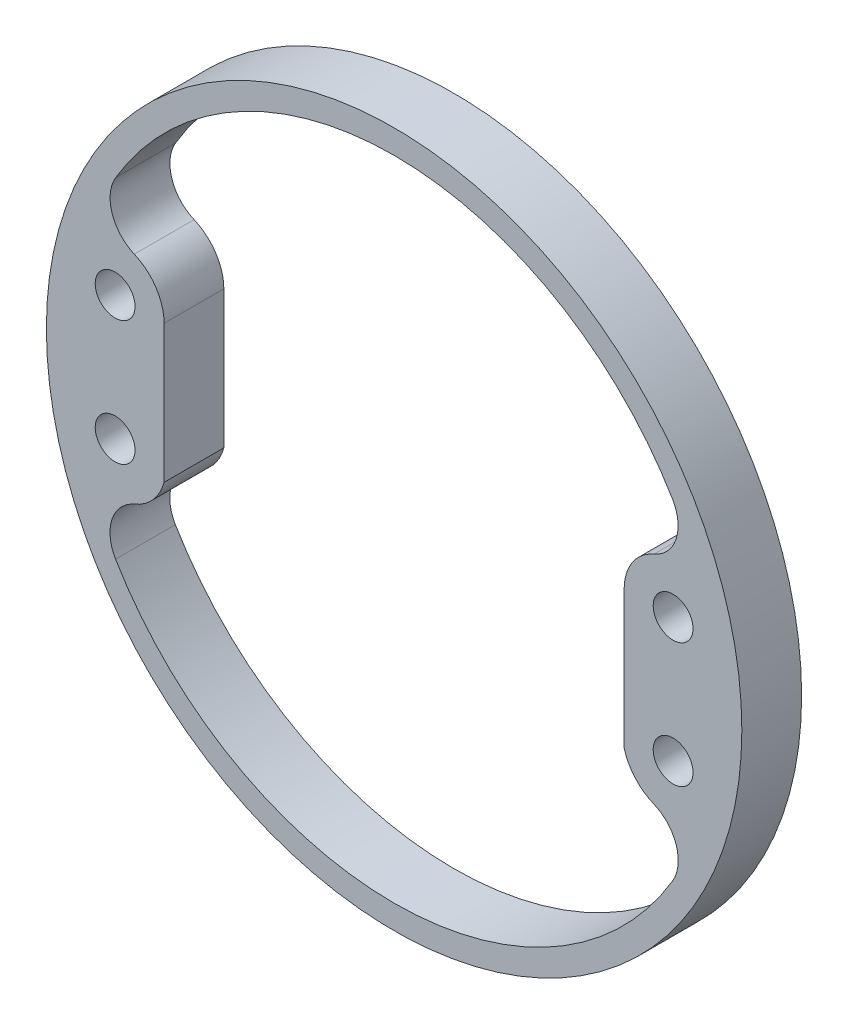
from build123d import *

# Parameters (mm, degrees)
SKETCH1_R      = 22.1615
SKETCH1_R_2    = 1.27
EXTRUDE2_DEPTH = 3.81
FILLET2_R      = 2.54


with BuildPart() as part:
    # Sketch1 → Extrude2 (new body)
    with BuildSketch(Plane.XY):
        with Locations(Location((0, 0, 0), (0, 0, 180))):
            Circle(SKETCH1_R)
        with Locations(Location((-17.78, -3.901479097, 0), (0, 0, 180))):
            Circle(SKETCH1_R_2, mode=Mode.SUBTRACT)
        with Locations(Location((17.78, -3.901479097, 0), (0, 0, 180))):
            Circle(SKETCH1_R_2, mode=Mode.SUBTRACT)
        with Locations(Location((-17.78, 4.036020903, 0), (0, 0, 180))):
            Circle(SKETCH1_R_2, mode=Mode.SUBTRACT)
        with BuildLine():
            Line((-14.660582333, -0.79375), (-14.660582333, 4.036020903))
            ThreePointArc((-14.660582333, 4.036020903), (-16.330721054, 6.798331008), (-19.552749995, 6.602755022))
            ThreePointArc((-19.552749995, 6.602755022), (0, 20.6375), (19.552749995, 6.602755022))
            ThreePointArc((19.552749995, 6.602755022), (16.330721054, 6.798331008), (14.660582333, 4.036020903))
            Line((14.660582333, 4.036020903), (14.660582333, -0.79375))
            Line((14.660582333, -0.79375), (14.660582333, -2.36859262))
            Line((14.660582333, -2.36859262), (14.660582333, -4.743362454))
            ThreePointArc((14.660582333, -4.743362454), (16.632082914, -6.921714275), (19.552749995, -6.602755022))
            ThreePointArc((19.552749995, -6.602755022), (0, -20.6375), (-19.552749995, -6.602755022))
            ThreePointArc((-19.552749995, -6.602755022), (-16.632082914, -6.921714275), (-14.660582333, -4.743362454))
            Line((-14.660582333, -4.743362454), (-14.660582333, -0.79375))
        make_face(mode=Mode.SUBTRACT)
        with Locations(Location((17.78, 4.036020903, 0), (0, 0, 180))):
            Circle(SKETCH1_R_2, mode=Mode.SUBTRACT)
    extrude(amount=EXTRUDE2_DEPTH)

    # Fillet2
    fillet2_edges = [part.edges().sort_by_distance(p)[0] for p in [
        (19.552749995, -6.602755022, 1.905),
        (19.552749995, 6.602755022, 1.905),
        (-19.552749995, 6.602755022, 1.905),
        (-19.552749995, -6.602755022, 1.905),
    ]]
    fillet(fillet2_edges, radius=FILLET2_R)


solid = part.part
